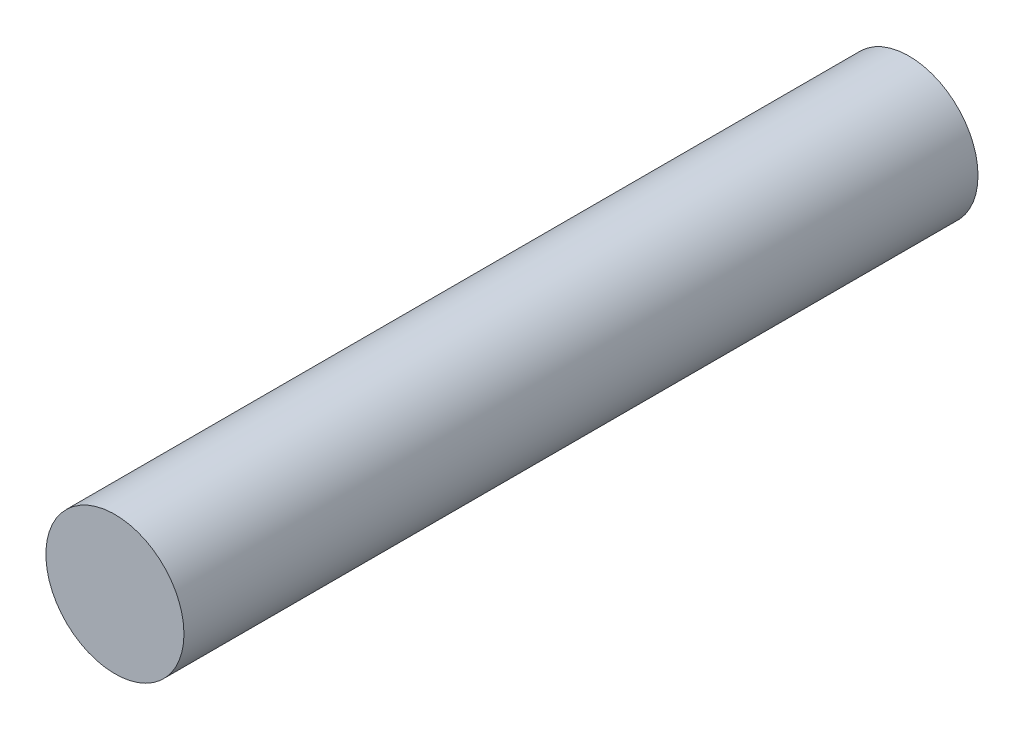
from build123d import *

# Parameters (mm, degrees)
ESQUISSE1_R          = 1
BASE_EXTRUSION_DEPTH = 11.5


with BuildPart() as part:
    # Esquisse1 → Base-Extrusion (new body)
    with BuildSketch(Plane.XY):
        Circle(ESQUISSE1_R)
    extrude(amount=BASE_EXTRUSION_DEPTH)


solid = part.part
